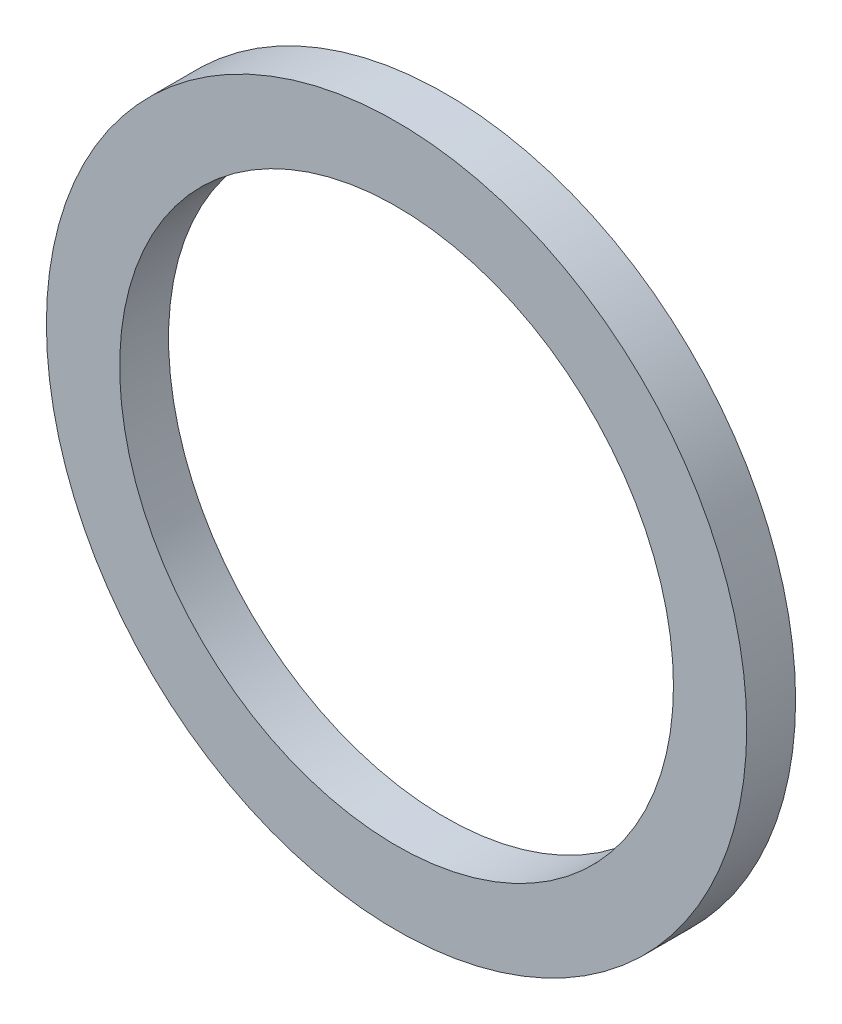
from build123d import *

# Parameters (mm, degrees)
ESQUISSE1_R          = 21.5
ESQUISSE1_R_2        = 17
BASE_EXTRUSION_DEPTH = 3


with BuildPart() as part:
    # Esquisse1 → Base-Extrusion (new body)
    with BuildSketch(Plane.XY):
        Circle(ESQUISSE1_R)
        Circle(ESQUISSE1_R_2, mode=Mode.SUBTRACT)
    extrude(amount=-BASE_EXTRUSION_DEPTH)


solid = part.part
